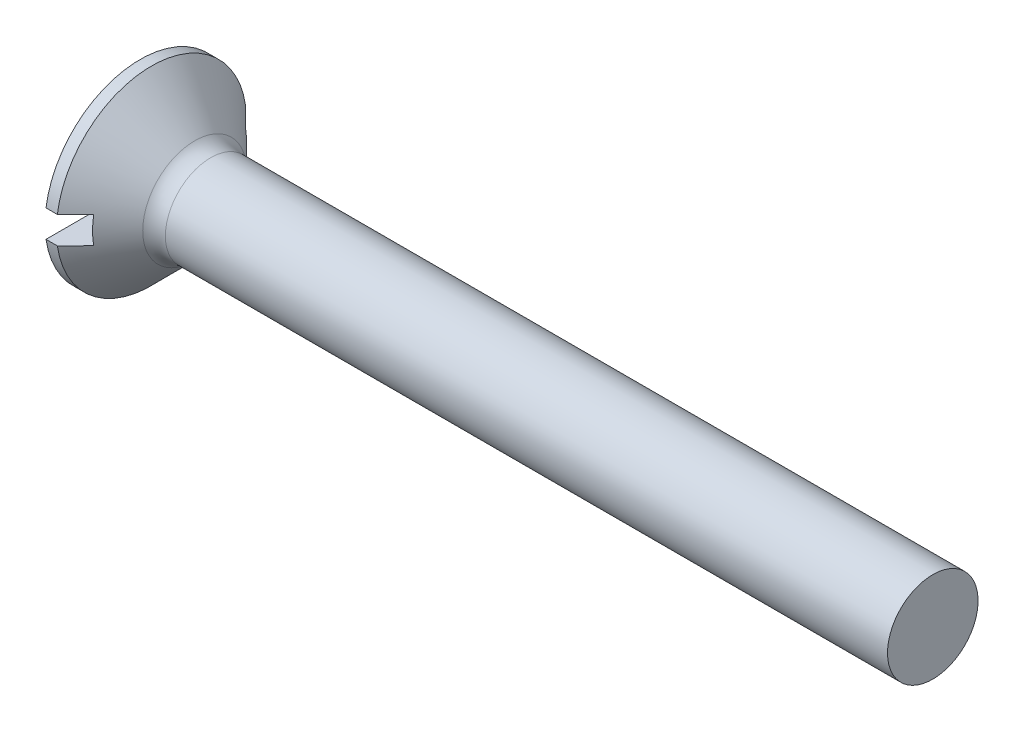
from build123d import *

# Parameters (mm, degrees)
FILLET1_R  = 1
SKETCH2_W  = 8.4
SKETCH2_H  = 1.2
SLOT_DEPTH = 1.3


with BuildPart() as part:
    # BodySke → Base-Revolve (revolve)
    with BuildSketch(Plane.XY, mode=Mode.PRIVATE) as base_revolve_sk:
        Polygon((0, 0), (0, 4.2), (0.5, 4.2), (2.7, 2), (35, 2), (35, 0), align=None)
    revolve(base_revolve_sk.sketch.rotate(Axis((-6.35, 0, 0), (1, 0, 0)), 90), axis=Axis((-6.35, 0, 0), (1, 0, 0)))

    # Fillet1
    fillet1_edges = [part.edges().sort_by_distance(p)[0] for p in [
        (2.7, 0, -2),
    ]]
    fillet(fillet1_edges, radius=FILLET1_R)

    # Sketch2 → Slot (cut)
    with BuildSketch(Plane.ZY):
        Rectangle(SKETCH2_W, SKETCH2_H)
    extrude(amount=-SLOT_DEPTH, mode=Mode.SUBTRACT)


solid = part.part
